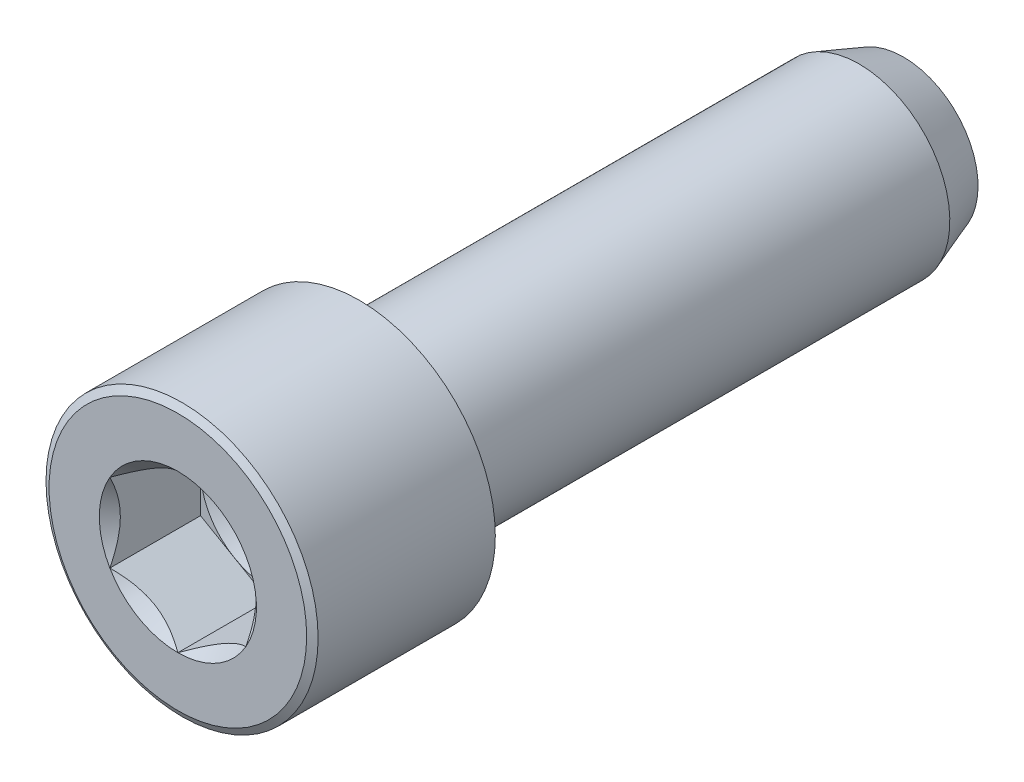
ISO-10303-21;
HEADER;
FILE_DESCRIPTION(('STEP AP214'),'2;1');
FILE_NAME('part.step','',(''),(''),'','','');
FILE_SCHEMA(('AUTOMOTIVE_DESIGN { 1 0 10303 214 1 1 1 1 }'));
ENDSEC;
DATA;
#1=APPLICATION_CONTEXT('core data for automotive mechanical design processes');
#2=APPLICATION_PROTOCOL_DEFINITION('international standard','automotive_design',2000,#1);
#3=PRODUCT_CONTEXT('',#1,'mechanical');
#4=PRODUCT('Part','Part','',(#3));
#5=PRODUCT_RELATED_PRODUCT_CATEGORY('part','',(#4));
#6=PRODUCT_DEFINITION_FORMATION('','',#4);
#7=PRODUCT_DEFINITION_CONTEXT('part definition',#1,'design');
#8=PRODUCT_DEFINITION('design','',#6,#7);
#9=PRODUCT_DEFINITION_SHAPE('','',#8);
#10=(LENGTH_UNIT() NAMED_UNIT(*) SI_UNIT(.MILLI.,.METRE.));
#11=(NAMED_UNIT(*) PLANE_ANGLE_UNIT() SI_UNIT($,.RADIAN.));
#12=(NAMED_UNIT(*) SI_UNIT($,.STERADIAN.) SOLID_ANGLE_UNIT());
#13=UNCERTAINTY_MEASURE_WITH_UNIT(LENGTH_MEASURE(1.E-05),#10,'distance_accuracy_value','');
#14=(GEOMETRIC_REPRESENTATION_CONTEXT(3) GLOBAL_UNCERTAINTY_ASSIGNED_CONTEXT((#13)) GLOBAL_UNIT_ASSIGNED_CONTEXT((#10,
#11,#12)) REPRESENTATION_CONTEXT('',''));
#15=CARTESIAN_POINT('',(0.,0.,0.));
#16=DIRECTION('',(0.,0.,1.));
#17=DIRECTION('',(1.,0.,0.));
#18=AXIS2_PLACEMENT_3D('',#15,#16,#17);
#19=CARTESIAN_POINT('',(-4.7625,0.,3.175));
#20=DIRECTION('',(0.,0.,-1.));
#21=DIRECTION('',(-1.,0.,0.));
#22=AXIS2_PLACEMENT_3D('',#19,#20,#21);
#23=PLANE('',#22);
#24=CARTESIAN_POINT('',(0.,0.,3.175));
#25=DIRECTION('',(0.,0.,1.));
#26=DIRECTION('',(1.,0.,0.));
#27=AXIS2_PLACEMENT_3D('',#24,#25,#26);
#28=CIRCLE('',#27,2.38125);
#29=CARTESIAN_POINT('',(2.38125,0.,3.175));
#30=VERTEX_POINT('',#29);
#31=CARTESIAN_POINT('',(1.190625,2.0622229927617,3.175));
#32=VERTEX_POINT('',#31);
#33=EDGE_CURVE('E54',#30,#32,#28,.T.);
#34=ORIENTED_EDGE('',*,*,#33,.F.);
#35=DIRECTION('',(0.,1.,0.));
#36=VECTOR('',#35,1.);
#37=CARTESIAN_POINT('',(2.38125,-1.3748153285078,3.175));
#38=LINE('',#37,#36);
#39=CARTESIAN_POINT('',(2.38125,1.3748153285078,3.175));
#40=VERTEX_POINT('',#39);
#41=EDGE_CURVE('E124',#30,#40,#38,.T.);
#42=ORIENTED_EDGE('',*,*,#41,.T.);
#43=DIRECTION('',(-0.866025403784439,0.5,0.));
#44=VECTOR('',#43,1.);
#45=CARTESIAN_POINT('',(2.38125,1.3748153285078,3.175));
#46=LINE('',#45,#44);
#47=EDGE_CURVE('E127',#40,#32,#46,.T.);
#48=ORIENTED_EDGE('',*,*,#47,.T.);
#49=EDGE_LOOP('',(#34,#42,#48));
#50=FACE_BOUND('',#49,.T.);
#51=ADVANCED_FACE('F37',(#50),#23,.F.);
#52=CARTESIAN_POINT('',(-1.190625,2.0622229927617,3.175));
#53=VERTEX_POINT('',#52);
#54=EDGE_CURVE('E11',#32,#53,#28,.T.);
#55=ORIENTED_EDGE('',*,*,#54,.F.);
#56=CARTESIAN_POINT('',(0.,2.7496306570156,3.175));
#57=VERTEX_POINT('',#56);
#58=EDGE_CURVE('E141',#32,#57,#46,.T.);
#59=ORIENTED_EDGE('',*,*,#58,.T.);
#60=DIRECTION('',(-0.866025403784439,-0.5,0.));
#61=VECTOR('',#60,1.);
#62=CARTESIAN_POINT('',(0.,2.7496306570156,3.175));
#63=LINE('',#62,#61);
#64=EDGE_CURVE('E147',#57,#53,#63,.T.);
#65=ORIENTED_EDGE('',*,*,#64,.T.);
#66=EDGE_LOOP('',(#55,#59,#65));
#67=FACE_BOUND('',#66,.T.);
#68=ADVANCED_FACE('F303',(#67),#23,.F.);
#69=CARTESIAN_POINT('',(-2.38125,0.,3.175));
#70=VERTEX_POINT('',#69);
#71=EDGE_CURVE('E52',#53,#70,#28,.T.);
#72=ORIENTED_EDGE('',*,*,#71,.F.);
#73=CARTESIAN_POINT('',(-2.38125,1.3748153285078,3.175));
#74=VERTEX_POINT('',#73);
#75=EDGE_CURVE('E146',#53,#74,#63,.T.);
#76=ORIENTED_EDGE('',*,*,#75,.T.);
#77=DIRECTION('',(0.,-1.,0.));
#78=VECTOR('',#77,1.);
#79=CARTESIAN_POINT('',(-2.38125,1.3748153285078,3.175));
#80=LINE('',#79,#78);
#81=EDGE_CURVE('E151',#74,#70,#80,.T.);
#82=ORIENTED_EDGE('',*,*,#81,.T.);
#83=EDGE_LOOP('',(#72,#76,#82));
#84=FACE_BOUND('',#83,.T.);
#85=ADVANCED_FACE('F307',(#84),#23,.F.);
#86=CARTESIAN_POINT('',(-1.190625,-2.0622229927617,3.175));
#87=VERTEX_POINT('',#86);
#88=EDGE_CURVE('E324',#70,#87,#28,.T.);
#89=ORIENTED_EDGE('',*,*,#88,.F.);
#90=CARTESIAN_POINT('',(-2.38125,-1.3748153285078,3.175));
#91=VERTEX_POINT('',#90);
#92=EDGE_CURVE('E150',#70,#91,#80,.T.);
#93=ORIENTED_EDGE('',*,*,#92,.T.);
#94=DIRECTION('',(0.866025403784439,-0.5,0.));
#95=VECTOR('',#94,1.);
#96=CARTESIAN_POINT('',(-2.38125,-1.3748153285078,3.175));
#97=LINE('',#96,#95);
#98=EDGE_CURVE('E244',#91,#87,#97,.T.);
#99=ORIENTED_EDGE('',*,*,#98,.T.);
#100=EDGE_LOOP('',(#89,#93,#99));
#101=FACE_BOUND('',#100,.T.);
#102=ADVANCED_FACE('F318',(#101),#23,.F.);
#103=CARTESIAN_POINT('',(1.190625,-2.06222299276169,3.175));
#104=VERTEX_POINT('',#103);
#105=EDGE_CURVE('E61',#87,#104,#28,.T.);
#106=ORIENTED_EDGE('',*,*,#105,.F.);
#107=CARTESIAN_POINT('',(0.,-2.74963065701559,3.175));
#108=VERTEX_POINT('',#107);
#109=EDGE_CURVE('E228',#87,#108,#97,.T.);
#110=ORIENTED_EDGE('',*,*,#109,.T.);
#111=DIRECTION('',(0.866025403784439,0.5,0.));
#112=VECTOR('',#111,1.);
#113=CARTESIAN_POINT('',(0.,-2.74963065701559,3.175));
#114=LINE('',#113,#112);
#115=EDGE_CURVE('E136',#108,#104,#114,.T.);
#116=ORIENTED_EDGE('',*,*,#115,.T.);
#117=EDGE_LOOP('',(#106,#110,#116));
#118=FACE_BOUND('',#117,.T.);
#119=ADVANCED_FACE('F311',(#118),#23,.F.);
#120=EDGE_CURVE('E114',#104,#30,#28,.T.);
#121=ORIENTED_EDGE('',*,*,#120,.F.);
#122=CARTESIAN_POINT('',(2.38125,-1.3748153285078,3.175));
#123=VERTEX_POINT('',#122);
#124=EDGE_CURVE('E139',#104,#123,#114,.T.);
#125=ORIENTED_EDGE('',*,*,#124,.T.);
#126=EDGE_CURVE('E132',#123,#30,#38,.T.);
#127=ORIENTED_EDGE('',*,*,#126,.T.);
#128=EDGE_LOOP('',(#121,#125,#127));
#129=FACE_BOUND('',#128,.T.);
#130=ADVANCED_FACE('F138',(#129),#23,.F.);
#131=CARTESIAN_POINT('',(0.,0.,0.));
#132=DIRECTION('',(0.,0.,-1.));
#133=DIRECTION('',(0.,1.,0.));
#134=AXIS2_PLACEMENT_3D('',#131,#132,#133);
#135=CYLINDRICAL_SURFACE('',#134,3.175);
#136=CARTESIAN_POINT('',(0.,0.,-17.4974234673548));
#137=DIRECTION('',(0.,0.,-1.));
#138=DIRECTION('',(0.,1.,0.));
#139=AXIS2_PLACEMENT_3D('',#136,#137,#138);
#140=CIRCLE('',#139,3.175);
#141=CARTESIAN_POINT('',(0.,3.175,-17.4974234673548));
#142=VERTEX_POINT('',#141);
#143=EDGE_CURVE('E178',#142,#142,#140,.T.);
#144=ORIENTED_EDGE('',*,*,#143,.F.);
#145=EDGE_LOOP('',(#144));
#146=FACE_BOUND('',#145,.T.);
#147=CARTESIAN_POINT('',(0.,0.,0.));
#148=DIRECTION('',(0.,0.,1.));
#149=DIRECTION('',(1.,0.,0.));
#150=AXIS2_PLACEMENT_3D('',#147,#148,#149);
#151=CIRCLE('',#150,3.175);
#152=CARTESIAN_POINT('',(3.175,0.,0.));
#153=VERTEX_POINT('',#152);
#154=EDGE_CURVE('E172',#153,#153,#151,.F.);
#155=ORIENTED_EDGE('',*,*,#154,.T.);
#156=EDGE_LOOP('',(#155));
#157=FACE_BOUND('',#156,.T.);
#158=ADVANCED_FACE('F310',(#146,#157),#135,.T.);
#159=CARTESIAN_POINT('',(0.,0.,-17.4974234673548));
#160=DIRECTION('',(0.,0.,1.));
#161=DIRECTION('',(0.,-1.,0.));
#162=AXIS2_PLACEMENT_3D('',#159,#160,#161);
#163=CONICAL_SURFACE('',#162,3.175,0.349065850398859);
#164=CARTESIAN_POINT('',(0.,0.,-19.05));
#165=DIRECTION('',(0.,0.,-1.));
#166=DIRECTION('',(0.,1.,0.));
#167=AXIS2_PLACEMENT_3D('',#164,#165,#166);
#168=CIRCLE('',#167,2.60990835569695);
#169=CARTESIAN_POINT('',(0.,2.60990835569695,-19.05));
#170=VERTEX_POINT('',#169);
#171=EDGE_CURVE('E175',#170,#170,#168,.T.);
#172=ORIENTED_EDGE('',*,*,#171,.F.);
#173=EDGE_LOOP('',(#172));
#174=FACE_BOUND('',#173,.T.);
#175=ORIENTED_EDGE('',*,*,#143,.T.);
#176=EDGE_LOOP('',(#175));
#177=FACE_BOUND('',#176,.T.);
#178=ADVANCED_FACE('F316',(#174,#177),#163,.T.);
#179=CARTESIAN_POINT('',(0.,0.,-19.05));
#180=DIRECTION('',(0.,0.,-1.));
#181=DIRECTION('',(0.,1.,0.));
#182=AXIS2_PLACEMENT_3D('',#179,#180,#181);
#183=PLANE('',#182);
#184=ORIENTED_EDGE('',*,*,#171,.T.);
#185=EDGE_LOOP('',(#184));
#186=FACE_BOUND('',#185,.T.);
#187=ADVANCED_FACE('F359',(#186),#183,.T.);
#188=CARTESIAN_POINT('',(0.,0.,6.35));
#189=DIRECTION('',(0.,0.,-1.));
#190=DIRECTION('',(-1.,0.,0.));
#191=AXIS2_PLACEMENT_3D('',#188,#189,#190);
#192=CYLINDRICAL_SURFACE('',#191,4.7625);
#193=CARTESIAN_POINT('',(0.,0.,6.20335303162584));
#194=DIRECTION('',(0.,0.,1.));
#195=DIRECTION('',(1.,0.,0.));
#196=AXIS2_PLACEMENT_3D('',#193,#194,#195);
#197=CIRCLE('',#196,4.7625);
#198=CARTESIAN_POINT('',(4.7625,0.,6.20335303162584));
#199=VERTEX_POINT('',#198);
#200=EDGE_CURVE('E183',#199,#199,#197,.F.);
#201=ORIENTED_EDGE('',*,*,#200,.T.);
#202=EDGE_LOOP('',(#201));
#203=FACE_BOUND('',#202,.T.);
#204=CARTESIAN_POINT('',(0.,0.,0.));
#205=DIRECTION('',(0.,0.,1.));
#206=DIRECTION('',(1.,0.,0.));
#207=AXIS2_PLACEMENT_3D('',#204,#205,#206);
#208=CIRCLE('',#207,4.7625);
#209=CARTESIAN_POINT('',(4.7625,0.,0.));
#210=VERTEX_POINT('',#209);
#211=EDGE_CURVE('E158',#210,#210,#208,.T.);
#212=ORIENTED_EDGE('',*,*,#211,.T.);
#213=EDGE_LOOP('',(#212));
#214=FACE_BOUND('',#213,.T.);
#215=ADVANCED_FACE('F355',(#203,#214),#192,.T.);
#216=CARTESIAN_POINT('',(0.,0.,6.35));
#217=DIRECTION('',(0.,0.,1.));
#218=DIRECTION('',(1.,0.,0.));
#219=AXIS2_PLACEMENT_3D('',#216,#217,#218);
#220=PLANE('',#219);
#221=CARTESIAN_POINT('',(0.,0.,6.35));
#222=DIRECTION('',(0.,0.,1.));
#223=DIRECTION('',(1.,0.,0.));
#224=AXIS2_PLACEMENT_3D('',#221,#222,#223);
#225=CIRCLE('',#224,2.74963065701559);
#226=CARTESIAN_POINT('',(2.38125,1.3748153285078,6.35));
#227=VERTEX_POINT('',#226);
#228=CARTESIAN_POINT('',(0.,2.74963065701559,6.35));
#229=VERTEX_POINT('',#228);
#230=EDGE_CURVE('E211',#227,#229,#225,.T.);
#231=ORIENTED_EDGE('',*,*,#230,.F.);
#232=CARTESIAN_POINT('',(2.38125,-1.3748153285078,6.35));
#233=VERTEX_POINT('',#232);
#234=EDGE_CURVE('E204',#233,#227,#225,.T.);
#235=ORIENTED_EDGE('',*,*,#234,.F.);
#236=CARTESIAN_POINT('',(0.,-2.74963065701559,6.35));
#237=VERTEX_POINT('',#236);
#238=EDGE_CURVE('E197',#237,#233,#225,.T.);
#239=ORIENTED_EDGE('',*,*,#238,.F.);
#240=CARTESIAN_POINT('',(-2.38125,-1.37481532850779,6.35));
#241=VERTEX_POINT('',#240);
#242=EDGE_CURVE('E203',#241,#237,#225,.T.);
#243=ORIENTED_EDGE('',*,*,#242,.F.);
#244=CARTESIAN_POINT('',(-2.38125,1.3748153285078,6.35));
#245=VERTEX_POINT('',#244);
#246=EDGE_CURVE('E68',#245,#241,#225,.T.);
#247=ORIENTED_EDGE('',*,*,#246,.F.);
#248=EDGE_CURVE('E219',#229,#245,#225,.T.);
#249=ORIENTED_EDGE('',*,*,#248,.F.);
#250=EDGE_LOOP('',(#231,#235,#239,#243,#247,#249));
#251=FACE_BOUND('',#250,.T.);
#252=CARTESIAN_POINT('',(0.,0.,6.35));
#253=DIRECTION('',(0.,0.,1.));
#254=DIRECTION('',(1.,0.,0.));
#255=AXIS2_PLACEMENT_3D('',#252,#253,#254);
#256=CIRCLE('',#255,4.5085);
#257=CARTESIAN_POINT('',(4.5085,0.,6.35));
#258=VERTEX_POINT('',#257);
#259=EDGE_CURVE('E181',#258,#258,#256,.T.);
#260=ORIENTED_EDGE('',*,*,#259,.T.);
#261=EDGE_LOOP('',(#260));
#262=FACE_BOUND('',#261,.T.);
#263=ADVANCED_FACE('F214',(#251,#262),#220,.T.);
#264=CARTESIAN_POINT('',(0.,0.,0.));
#265=DIRECTION('',(0.,0.,1.));
#266=DIRECTION('',(1.,0.,0.));
#267=AXIS2_PLACEMENT_3D('',#264,#265,#266);
#268=PLANE('',#267);
#269=ORIENTED_EDGE('',*,*,#154,.F.);
#270=EDGE_LOOP('',(#269));
#271=FACE_BOUND('',#270,.T.);
#272=ORIENTED_EDGE('',*,*,#211,.F.);
#273=EDGE_LOOP('',(#272));
#274=FACE_BOUND('',#273,.T.);
#275=ADVANCED_FACE('F345',(#271,#274),#268,.F.);
#276=CARTESIAN_POINT('',(0.,0.,6.35));
#277=DIRECTION('',(0.,0.,-1.));
#278=DIRECTION('',(-1.,0.,0.));
#279=AXIS2_PLACEMENT_3D('',#276,#277,#278);
#280=CONICAL_SURFACE('',#279,4.5085,1.0471975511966);
#281=ORIENTED_EDGE('',*,*,#200,.F.);
#282=EDGE_LOOP('',(#281));
#283=FACE_BOUND('',#282,.T.);
#284=ORIENTED_EDGE('',*,*,#259,.F.);
#285=EDGE_LOOP('',(#284));
#286=FACE_BOUND('',#285,.T.);
#287=ADVANCED_FACE('F39',(#283,#286),#280,.T.);
#288=CARTESIAN_POINT('',(0.,0.,6.35));
#289=DIRECTION('',(0.,0.,1.));
#290=DIRECTION('',(1.,0.,0.));
#291=AXIS2_PLACEMENT_3D('',#288,#289,#290);
#292=CONICAL_SURFACE('',#291,2.74963065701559,0.78539816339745);
#293=ORIENTED_EDGE('',*,*,#238,.T.);
#294=CARTESIAN_POINT('',(-0.000200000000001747,-2.74974612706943,6.35011547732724));
#295=CARTESIAN_POINT('',(0.0816567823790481,-2.70248609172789,6.30289489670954));
#296=CARTESIAN_POINT('',(0.164882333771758,-2.65443579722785,6.2584475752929));
#297=CARTESIAN_POINT('',(0.334588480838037,-2.556455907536,6.17706545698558));
#298=CARTESIAN_POINT('',(0.4210852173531,-2.50651699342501,6.14017594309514));
#299=CARTESIAN_POINT('',(0.59550177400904,-2.40581754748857,6.07698341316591));
#300=CARTESIAN_POINT('',(0.683377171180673,-2.35508266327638,6.05052155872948));
#301=CARTESIAN_POINT('',(0.861062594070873,-2.25249593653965,6.00975151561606));
#302=CARTESIAN_POINT('',(0.950867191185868,-2.20064722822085,5.99541289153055));
#303=CARTESIAN_POINT('',(1.10563960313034,-2.11128933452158,5.98247578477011));
#304=CARTESIAN_POINT('',(1.17040744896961,-2.07389560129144,5.98056060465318));
#305=CARTESIAN_POINT('',(1.29983727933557,-1.99916925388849,5.98378662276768));
#306=CARTESIAN_POINT('',(1.36449921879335,-1.96183666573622,5.98893029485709));
#307=CARTESIAN_POINT('',(1.49321254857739,-1.88752399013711,6.00598131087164));
#308=CARTESIAN_POINT('',(1.55726317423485,-1.85054434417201,6.01789622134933));
#309=CARTESIAN_POINT('',(1.68425683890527,-1.77722451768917,6.04783567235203));
#310=CARTESIAN_POINT('',(1.74719996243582,-1.74088428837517,6.06585974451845));
#311=CARTESIAN_POINT('',(1.90842615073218,-1.64780030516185,6.11936880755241));
#312=CARTESIAN_POINT('',(2.00570949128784,-1.59163374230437,6.15888742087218));
#313=CARTESIAN_POINT('',(2.14875606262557,-1.50904576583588,6.2256003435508));
#314=CARTESIAN_POINT('',(2.19589628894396,-1.48182934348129,6.24904020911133));
#315=CARTESIAN_POINT('',(2.28930352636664,-1.42790064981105,6.29805667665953));
#316=CARTESIAN_POINT('',(2.33557105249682,-1.40118808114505,6.32363196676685));
#317=CARTESIAN_POINT('',(2.38145,-1.37469985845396,6.35011547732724));
#318=B_SPLINE_CURVE_WITH_KNOTS('',3,(#294,#295,#296,#297,#298,#299,#300,#301,#302,#303,#304,
#305,#306,#307,#308,#309,#310,#311,#312,#313,#314,#315,#316,#317),.UNSPECIFIED.,.F.,.F.,(4,2,2,
2,2,2,2,2,2,2,2,4),(0.,0.317196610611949,0.636241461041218,0.950218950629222,1.26340583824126,
1.48752413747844,1.71172100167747,1.93616888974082,2.16059957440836,2.51709639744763,
2.69486147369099,2.87251813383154),.UNSPECIFIED.);
#319=EDGE_CURVE('E41',#237,#233,#318,.T.);
#320=ORIENTED_EDGE('',*,*,#319,.F.);
#321=EDGE_LOOP('',(#293,#320));
#322=FACE_BOUND('',#321,.T.);
#323=ADVANCED_FACE('F199',(#322),#292,.F.);
#324=ORIENTED_EDGE('',*,*,#234,.T.);
#325=CARTESIAN_POINT('',(2.38125,-2.74194290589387,7.23198089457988));
#326=CARTESIAN_POINT('',(2.38125,-2.67517961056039,7.18158466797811));
#327=CARTESIAN_POINT('',(2.38125,-2.60804251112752,7.1316755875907));
#328=CARTESIAN_POINT('',(2.38125,-2.47287325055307,7.03304983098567));
#329=CARTESIAN_POINT('',(2.38125,-2.40484086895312,6.98433345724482));
#330=CARTESIAN_POINT('',(2.38125,-2.26723593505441,6.88796485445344));
#331=CARTESIAN_POINT('',(2.38125,-2.19765553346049,6.84032379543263));
#332=CARTESIAN_POINT('',(2.38125,-2.05731367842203,6.74681992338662));
#333=CARTESIAN_POINT('',(2.38125,-1.98655230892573,6.7009569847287));
#334=CARTESIAN_POINT('',(2.38125,-1.83957751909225,6.60884590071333));
#335=CARTESIAN_POINT('',(2.38125,-1.76328361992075,6.56272551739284));
#336=CARTESIAN_POINT('',(2.38125,-1.6089135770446,6.47351830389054));
#337=CARTESIAN_POINT('',(2.38125,-1.53083712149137,6.43043200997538));
#338=CARTESIAN_POINT('',(2.38125,-1.37291620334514,6.3482265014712));
#339=CARTESIAN_POINT('',(2.38125,-1.29307799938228,6.30909535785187));
#340=CARTESIAN_POINT('',(2.38125,-1.13121425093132,6.23566795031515));
#341=CARTESIAN_POINT('',(2.38125,-1.04918943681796,6.20137009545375));
#342=CARTESIAN_POINT('',(2.38125,-0.889535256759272,6.14135463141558));
#343=CARTESIAN_POINT('',(2.38125,-0.812083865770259,6.11516847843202));
#344=CARTESIAN_POINT('',(2.38125,-0.655316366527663,6.06900975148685));
#345=CARTESIAN_POINT('',(2.38125,-0.576000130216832,6.04903760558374));
#346=CARTESIAN_POINT('',(2.38125,-0.417295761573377,6.0166821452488));
#347=CARTESIAN_POINT('',(2.38125,-0.337934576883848,6.00416880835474));
#348=CARTESIAN_POINT('',(2.38125,-0.178363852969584,5.98697386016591));
#349=CARTESIAN_POINT('',(2.38125,-0.0981544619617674,5.98229090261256));
#350=CARTESIAN_POINT('',(2.38125,0.0594188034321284,5.98110444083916));
#351=CARTESIAN_POINT('',(2.38125,0.136780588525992,5.9843110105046));
#352=CARTESIAN_POINT('',(2.38125,0.290840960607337,5.99808705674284));
#353=CARTESIAN_POINT('',(2.38125,0.367539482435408,6.00865724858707));
#354=CARTESIAN_POINT('',(2.38125,0.521017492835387,6.03676282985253));
#355=CARTESIAN_POINT('',(2.38125,0.597774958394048,6.05441674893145));
#356=CARTESIAN_POINT('',(2.38125,0.749609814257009,6.0957513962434));
#357=CARTESIAN_POINT('',(2.38125,0.824687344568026,6.11943162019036));
#358=CARTESIAN_POINT('',(2.38125,1.06107814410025,6.20289486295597));
#359=CARTESIAN_POINT('',(2.38125,1.21904786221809,6.27218392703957));
#360=CARTESIAN_POINT('',(2.38125,1.45021000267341,6.38766408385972));
#361=CARTESIAN_POINT('',(2.38125,1.52644290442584,6.42817305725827));
#362=CARTESIAN_POINT('',(2.38125,1.67717618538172,6.51230268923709));
#363=CARTESIAN_POINT('',(2.38125,1.75167687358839,6.55592278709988));
#364=CARTESIAN_POINT('',(2.38125,1.89548152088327,6.64341255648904));
#365=CARTESIAN_POINT('',(2.38125,1.96485959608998,6.6871617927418));
#366=CARTESIAN_POINT('',(2.38125,2.10242624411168,6.77650115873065));
#367=CARTESIAN_POINT('',(2.38125,2.17061472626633,6.82209142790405));
#368=CARTESIAN_POINT('',(2.38125,2.30540317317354,6.91440600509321));
#369=CARTESIAN_POINT('',(2.38125,2.37201154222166,6.96111809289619));
#370=CARTESIAN_POINT('',(2.38125,2.50431800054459,7.05577757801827));
#371=CARTESIAN_POINT('',(2.38125,2.57001633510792,7.10372463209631));
#372=CARTESIAN_POINT('',(2.38125,2.63533378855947,7.15217673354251));
#373=B_SPLINE_CURVE_WITH_KNOTS('',3,(#325,#326,#327,#328,#329,#330,#331,#332,#333,#334,#335,
#336,#337,#338,#339,#340,#341,#342,#343,#344,#345,#346,#347,#348,#349,#350,#351,#352,#353,#354,
#355,#356,#357,#358,#359,#360,#361,#362,#363,#364,#365,#366,#367,#368,#369,#370,#371,#372),
.UNSPECIFIED.,.F.,.F.,(4,2,2,2,2,2,2,2,2,2,2,2,2,2,2,2,2,2,2,2,2,2,2,4),(0.,0.250951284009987,
0.501965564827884,0.754924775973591,1.00786608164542,1.27526207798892,1.54270521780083,
1.80931602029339,2.07583885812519,2.32089852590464,2.56597507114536,2.80664400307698,
3.04727155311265,3.27918940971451,3.51112979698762,3.74712477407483,3.98310000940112,
4.49898139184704,4.75794323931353,5.01685853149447,5.26288960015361,5.50893933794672,
5.75299038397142,5.9969743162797),.UNSPECIFIED.);
#374=EDGE_CURVE('E207',#233,#227,#373,.T.);
#375=ORIENTED_EDGE('',*,*,#374,.F.);
#376=EDGE_LOOP('',(#324,#375));
#377=FACE_BOUND('',#376,.T.);
#378=ADVANCED_FACE('F208',(#377),#292,.F.);
#379=ORIENTED_EDGE('',*,*,#230,.T.);
#380=CARTESIAN_POINT('',(2.38145,1.37469985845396,6.35011547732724));
#381=CARTESIAN_POINT('',(2.29959321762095,1.4219598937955,6.30289489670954));
#382=CARTESIAN_POINT('',(2.21636766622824,1.47001018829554,6.2584475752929));
#383=CARTESIAN_POINT('',(2.04666151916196,1.56799007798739,6.17706545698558));
#384=CARTESIAN_POINT('',(1.9601647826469,1.61792899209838,6.14017594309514));
#385=CARTESIAN_POINT('',(1.78574822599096,1.71862843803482,6.07698341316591));
#386=CARTESIAN_POINT('',(1.69787282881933,1.76936332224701,6.05052155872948));
#387=CARTESIAN_POINT('',(1.52018740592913,1.87195004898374,6.00975151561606));
#388=CARTESIAN_POINT('',(1.43038280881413,1.92379875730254,5.99541289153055));
#389=CARTESIAN_POINT('',(1.27561039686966,2.01315665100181,5.98247578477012));
#390=CARTESIAN_POINT('',(1.21084255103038,2.05055038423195,5.98056060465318));
#391=CARTESIAN_POINT('',(1.08141272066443,2.1252767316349,5.98378662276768));
#392=CARTESIAN_POINT('',(1.01675078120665,2.16260931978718,5.98893029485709));
#393=CARTESIAN_POINT('',(0.888037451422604,2.23692199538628,6.00598131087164));
#394=CARTESIAN_POINT('',(0.823986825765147,2.27390164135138,6.01789622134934));
#395=CARTESIAN_POINT('',(0.696993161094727,2.34722146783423,6.04783567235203));
#396=CARTESIAN_POINT('',(0.634050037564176,2.38356169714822,6.06585974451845));
#397=CARTESIAN_POINT('',(0.472823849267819,2.47664568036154,6.11936880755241));
#398=CARTESIAN_POINT('',(0.37554050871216,2.53281224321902,6.15888742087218));
#399=CARTESIAN_POINT('',(0.23249393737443,2.61540021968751,6.2256003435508));
#400=CARTESIAN_POINT('',(0.185353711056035,2.6426166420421,6.24904020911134));
#401=CARTESIAN_POINT('',(0.0919464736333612,2.69654533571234,6.29805667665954));
#402=CARTESIAN_POINT('',(0.0456789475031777,2.72325790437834,6.32363196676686));
#403=CARTESIAN_POINT('',(-0.000200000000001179,2.74974612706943,6.35011547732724));
#404=B_SPLINE_CURVE_WITH_KNOTS('',3,(#380,#381,#382,#383,#384,#385,#386,#387,#388,#389,#390,
#391,#392,#393,#394,#395,#396,#397,#398,#399,#400,#401,#402,#403),.UNSPECIFIED.,.F.,.F.,(4,2,2,
2,2,2,2,2,2,2,2,4),(0.,0.317196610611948,0.636241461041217,0.950218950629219,1.26340583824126,
1.48752413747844,1.71172100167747,1.93616888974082,2.16059957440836,2.51709639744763,
2.69486147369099,2.87251813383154),.UNSPECIFIED.);
#405=EDGE_CURVE('E210',#227,#229,#404,.T.);
#406=ORIENTED_EDGE('',*,*,#405,.F.);
#407=EDGE_LOOP('',(#379,#406));
#408=FACE_BOUND('',#407,.T.);
#409=ADVANCED_FACE('F333',(#408),#292,.F.);
#410=ORIENTED_EDGE('',*,*,#248,.T.);
#411=CARTESIAN_POINT('',(0.000199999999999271,2.74974612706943,6.35011547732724));
#412=CARTESIAN_POINT('',(-0.0816567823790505,2.70248609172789,6.30289489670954));
#413=CARTESIAN_POINT('',(-0.16488233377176,2.65443579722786,6.2584475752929));
#414=CARTESIAN_POINT('',(-0.334588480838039,2.55645590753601,6.17706545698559));
#415=CARTESIAN_POINT('',(-0.421085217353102,2.50651699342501,6.14017594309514));
#416=CARTESIAN_POINT('',(-0.595501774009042,2.40581754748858,6.07698341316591));
#417=CARTESIAN_POINT('',(-0.683377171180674,2.35508266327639,6.05052155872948));
#418=CARTESIAN_POINT('',(-0.861062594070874,2.25249593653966,6.00975151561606));
#419=CARTESIAN_POINT('',(-0.950867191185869,2.20064722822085,5.99541289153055));
#420=CARTESIAN_POINT('',(-1.10563960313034,2.11128933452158,5.98247578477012));
#421=CARTESIAN_POINT('',(-1.17040744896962,2.07389560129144,5.98056060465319));
#422=CARTESIAN_POINT('',(-1.29983727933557,1.99916925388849,5.98378662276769));
#423=CARTESIAN_POINT('',(-1.36449921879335,1.96183666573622,5.98893029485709));
#424=CARTESIAN_POINT('',(-1.4932125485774,1.88752399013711,6.00598131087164));
#425=CARTESIAN_POINT('',(-1.55726317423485,1.85054434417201,6.01789622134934));
#426=CARTESIAN_POINT('',(-1.68425683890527,1.77722451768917,6.04783567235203));
#427=CARTESIAN_POINT('',(-1.74719996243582,1.74088428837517,6.06585974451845));
#428=CARTESIAN_POINT('',(-1.90842615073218,1.64780030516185,6.11936880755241));
#429=CARTESIAN_POINT('',(-2.00570949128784,1.59163374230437,6.15888742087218));
#430=CARTESIAN_POINT('',(-2.14875606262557,1.50904576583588,6.2256003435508));
#431=CARTESIAN_POINT('',(-2.19589628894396,1.4818293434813,6.24904020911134));
#432=CARTESIAN_POINT('',(-2.28930352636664,1.42790064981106,6.29805667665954));
#433=CARTESIAN_POINT('',(-2.33557105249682,1.40118808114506,6.32363196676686));
#434=CARTESIAN_POINT('',(-2.38145,1.37469985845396,6.35011547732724));
#435=B_SPLINE_CURVE_WITH_KNOTS('',3,(#411,#412,#413,#414,#415,#416,#417,#418,#419,#420,#421,
#422,#423,#424,#425,#426,#427,#428,#429,#430,#431,#432,#433,#434),.UNSPECIFIED.,.F.,.F.,(4,2,2,
2,2,2,2,2,2,2,2,4),(0.,0.317196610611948,0.636241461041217,0.95021895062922,1.26340583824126,
1.48752413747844,1.71172100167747,1.93616888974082,2.16059957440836,2.51709639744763,
2.69486147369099,2.87251813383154),.UNSPECIFIED.);
#436=EDGE_CURVE('E239',#229,#245,#435,.T.);
#437=ORIENTED_EDGE('',*,*,#436,.F.);
#438=EDGE_LOOP('',(#410,#437));
#439=FACE_BOUND('',#438,.T.);
#440=ADVANCED_FACE('F331',(#439),#292,.F.);
#441=ORIENTED_EDGE('',*,*,#246,.T.);
#442=CARTESIAN_POINT('',(-2.38125,-2.74194290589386,7.23198089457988));
#443=CARTESIAN_POINT('',(-2.38125,-2.67517961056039,7.18158466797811));
#444=CARTESIAN_POINT('',(-2.38125,-2.60804251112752,7.13167558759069));
#445=CARTESIAN_POINT('',(-2.38125,-2.47287325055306,7.03304983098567));
#446=CARTESIAN_POINT('',(-2.38125,-2.40484086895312,6.98433345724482));
#447=CARTESIAN_POINT('',(-2.38125,-2.26723593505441,6.88796485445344));
#448=CARTESIAN_POINT('',(-2.38125,-2.19765553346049,6.84032379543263));
#449=CARTESIAN_POINT('',(-2.38125,-2.05731367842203,6.74681992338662));
#450=CARTESIAN_POINT('',(-2.38125,-1.98655230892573,6.7009569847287));
#451=CARTESIAN_POINT('',(-2.38125,-1.83957751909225,6.60884590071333));
#452=CARTESIAN_POINT('',(-2.38125,-1.76328361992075,6.56272551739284));
#453=CARTESIAN_POINT('',(-2.38125,-1.60891357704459,6.47351830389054));
#454=CARTESIAN_POINT('',(-2.38125,-1.53083712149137,6.43043200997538));
#455=CARTESIAN_POINT('',(-2.38125,-1.37291620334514,6.3482265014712));
#456=CARTESIAN_POINT('',(-2.38125,-1.29307799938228,6.30909535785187));
#457=CARTESIAN_POINT('',(-2.38125,-1.13121425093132,6.23566795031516));
#458=CARTESIAN_POINT('',(-2.38125,-1.04918943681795,6.20137009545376));
#459=CARTESIAN_POINT('',(-2.38125,-0.889535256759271,6.14135463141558));
#460=CARTESIAN_POINT('',(-2.38125,-0.812083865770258,6.11516847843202));
#461=CARTESIAN_POINT('',(-2.38125,-0.655316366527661,6.06900975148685));
#462=CARTESIAN_POINT('',(-2.38125,-0.57600013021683,6.04903760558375));
#463=CARTESIAN_POINT('',(-2.38125,-0.417295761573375,6.0166821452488));
#464=CARTESIAN_POINT('',(-2.38125,-0.337934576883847,6.00416880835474));
#465=CARTESIAN_POINT('',(-2.38125,-0.178363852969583,5.98697386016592));
#466=CARTESIAN_POINT('',(-2.38125,-0.0981544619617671,5.98229090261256));
#467=CARTESIAN_POINT('',(-2.38125,0.0594188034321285,5.98110444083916));
#468=CARTESIAN_POINT('',(-2.38125,0.136780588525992,5.9843110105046));
#469=CARTESIAN_POINT('',(-2.38125,0.290840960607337,5.99808705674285));
#470=CARTESIAN_POINT('',(-2.38125,0.367539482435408,6.00865724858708));
#471=CARTESIAN_POINT('',(-2.38125,0.521017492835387,6.03676282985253));
#472=CARTESIAN_POINT('',(-2.38125,0.597774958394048,6.05441674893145));
#473=CARTESIAN_POINT('',(-2.38125,0.749609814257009,6.0957513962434));
#474=CARTESIAN_POINT('',(-2.38125,0.824687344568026,6.11943162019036));
#475=CARTESIAN_POINT('',(-2.38125,1.06107814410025,6.20289486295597));
#476=CARTESIAN_POINT('',(-2.38125,1.2190478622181,6.27218392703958));
#477=CARTESIAN_POINT('',(-2.38125,1.45021000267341,6.38766408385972));
#478=CARTESIAN_POINT('',(-2.38125,1.52644290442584,6.42817305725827));
#479=CARTESIAN_POINT('',(-2.38125,1.67717618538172,6.51230268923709));
#480=CARTESIAN_POINT('',(-2.38125,1.75167687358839,6.55592278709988));
#481=CARTESIAN_POINT('',(-2.38125,1.89548152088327,6.64341255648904));
#482=CARTESIAN_POINT('',(-2.38125,1.96485959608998,6.6871617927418));
#483=CARTESIAN_POINT('',(-2.38125,2.10242624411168,6.77650115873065));
#484=CARTESIAN_POINT('',(-2.38125,2.17061472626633,6.82209142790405));
#485=CARTESIAN_POINT('',(-2.38125,2.30540317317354,6.91440600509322));
#486=CARTESIAN_POINT('',(-2.38125,2.37201154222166,6.96111809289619));
#487=CARTESIAN_POINT('',(-2.38125,2.50431800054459,7.05577757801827));
#488=CARTESIAN_POINT('',(-2.38125,2.57001633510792,7.10372463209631));
#489=CARTESIAN_POINT('',(-2.38125,2.63533378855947,7.15217673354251));
#490=B_SPLINE_CURVE_WITH_KNOTS('',3,(#442,#443,#444,#445,#446,#447,#448,#449,#450,#451,#452,
#453,#454,#455,#456,#457,#458,#459,#460,#461,#462,#463,#464,#465,#466,#467,#468,#469,#470,#471,
#472,#473,#474,#475,#476,#477,#478,#479,#480,#481,#482,#483,#484,#485,#486,#487,#488,#489),
.UNSPECIFIED.,.F.,.F.,(4,2,2,2,2,2,2,2,2,2,2,2,2,2,2,2,2,2,2,2,2,2,2,4),(0.,0.250951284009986,
0.501965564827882,0.754924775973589,1.00786608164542,1.27526207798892,1.54270521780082,
1.80931602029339,2.07583885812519,2.32089852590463,2.56597507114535,2.80664400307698,
3.04727155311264,3.2791894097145,3.51112979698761,3.74712477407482,3.98310000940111,
4.49898139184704,4.75794323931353,5.01685853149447,5.2628896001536,5.50893933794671,
5.75299038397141,5.99697431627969),.UNSPECIFIED.);
#491=EDGE_CURVE('E229',#245,#241,#490,.F.);
#492=ORIENTED_EDGE('',*,*,#491,.F.);
#493=EDGE_LOOP('',(#441,#492));
#494=FACE_BOUND('',#493,.T.);
#495=ADVANCED_FACE('F264',(#494),#292,.F.);
#496=ORIENTED_EDGE('',*,*,#242,.T.);
#497=CARTESIAN_POINT('',(-2.38145,-1.37469985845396,6.35011547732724));
#498=CARTESIAN_POINT('',(-2.29959321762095,-1.4219598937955,6.30289489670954));
#499=CARTESIAN_POINT('',(-2.21636766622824,-1.47001018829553,6.2584475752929));
#500=CARTESIAN_POINT('',(-2.04666151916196,-1.56799007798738,6.17706545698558));
#501=CARTESIAN_POINT('',(-1.9601647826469,-1.61792899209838,6.14017594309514));
#502=CARTESIAN_POINT('',(-1.78574822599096,-1.71862843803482,6.07698341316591));
#503=CARTESIAN_POINT('',(-1.69787282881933,-1.769363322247,6.05052155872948));
#504=CARTESIAN_POINT('',(-1.52018740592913,-1.87195004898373,6.00975151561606));
#505=CARTESIAN_POINT('',(-1.43038280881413,-1.92379875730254,5.99541289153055));
#506=CARTESIAN_POINT('',(-1.27561039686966,-2.01315665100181,5.98247578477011));
#507=CARTESIAN_POINT('',(-1.21084255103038,-2.05055038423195,5.98056060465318));
#508=CARTESIAN_POINT('',(-1.08141272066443,-2.1252767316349,5.98378662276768));
#509=CARTESIAN_POINT('',(-1.01675078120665,-2.16260931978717,5.98893029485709));
#510=CARTESIAN_POINT('',(-0.888037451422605,-2.23692199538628,6.00598131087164));
#511=CARTESIAN_POINT('',(-0.823986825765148,-2.27390164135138,6.01789622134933));
#512=CARTESIAN_POINT('',(-0.696993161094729,-2.34722146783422,6.04783567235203));
#513=CARTESIAN_POINT('',(-0.634050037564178,-2.38356169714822,6.06585974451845));
#514=CARTESIAN_POINT('',(-0.472823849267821,-2.47664568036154,6.11936880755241));
#515=CARTESIAN_POINT('',(-0.375540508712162,-2.53281224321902,6.15888742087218));
#516=CARTESIAN_POINT('',(-0.232493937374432,-2.61540021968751,6.2256003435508));
#517=CARTESIAN_POINT('',(-0.185353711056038,-2.64261664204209,6.24904020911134));
#518=CARTESIAN_POINT('',(-0.0919464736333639,-2.69654533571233,6.29805667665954));
#519=CARTESIAN_POINT('',(-0.0456789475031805,-2.72325790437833,6.32363196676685));
#520=CARTESIAN_POINT('',(0.000199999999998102,-2.74974612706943,6.35011547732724));
#521=B_SPLINE_CURVE_WITH_KNOTS('',3,(#497,#498,#499,#500,#501,#502,#503,#504,#505,#506,#507,
#508,#509,#510,#511,#512,#513,#514,#515,#516,#517,#518,#519,#520),.UNSPECIFIED.,.F.,.F.,(4,2,2,
2,2,2,2,2,2,2,2,4),(0.,0.317196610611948,0.636241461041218,0.950218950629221,1.26340583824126,
1.48752413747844,1.71172100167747,1.93616888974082,2.16059957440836,2.51709639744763,
2.69486147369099,2.87251813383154),.UNSPECIFIED.);
#522=EDGE_CURVE('E225',#241,#237,#521,.T.);
#523=ORIENTED_EDGE('',*,*,#522,.F.);
#524=EDGE_LOOP('',(#496,#523));
#525=FACE_BOUND('',#524,.T.);
#526=ADVANCED_FACE('F224',(#525),#292,.F.);
#527=CARTESIAN_POINT('',(0.,-2.74963065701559,3.175));
#528=DIRECTION('',(0.5,-0.866025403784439,0.));
#529=DIRECTION('',(0.866025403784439,0.5,0.));
#530=AXIS2_PLACEMENT_3D('',#527,#528,#529);
#531=PLANE('',#530);
#532=DIRECTION('',(0.,0.,1.));
#533=VECTOR('',#532,1.);
#534=CARTESIAN_POINT('',(0.,-2.74963065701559,3.175));
#535=LINE('',#534,#533);
#536=EDGE_CURVE('E154',#108,#237,#535,.T.);
#537=ORIENTED_EDGE('',*,*,#536,.T.);
#538=ORIENTED_EDGE('',*,*,#319,.T.);
#539=DIRECTION('',(0.,0.,1.));
#540=VECTOR('',#539,1.);
#541=CARTESIAN_POINT('',(2.38125,-1.3748153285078,3.175));
#542=LINE('',#541,#540);
#543=EDGE_CURVE('E166',#123,#233,#542,.T.);
#544=ORIENTED_EDGE('',*,*,#543,.F.);
#545=ORIENTED_EDGE('',*,*,#124,.F.);
#546=ORIENTED_EDGE('',*,*,#115,.F.);
#547=EDGE_LOOP('',(#537,#538,#544,#545,#546));
#548=FACE_BOUND('',#547,.T.);
#549=ADVANCED_FACE('F191',(#548),#531,.F.);
#550=CARTESIAN_POINT('',(2.38125,-1.3748153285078,3.175));
#551=DIRECTION('',(1.,0.,0.));
#552=DIRECTION('',(0.,1.,0.));
#553=AXIS2_PLACEMENT_3D('',#550,#551,#552);
#554=PLANE('',#553);
#555=ORIENTED_EDGE('',*,*,#543,.T.);
#556=ORIENTED_EDGE('',*,*,#374,.T.);
#557=DIRECTION('',(0.,0.,1.));
#558=VECTOR('',#557,1.);
#559=CARTESIAN_POINT('',(2.38125,1.3748153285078,3.175));
#560=LINE('',#559,#558);
#561=EDGE_CURVE('E135',#40,#227,#560,.T.);
#562=ORIENTED_EDGE('',*,*,#561,.F.);
#563=ORIENTED_EDGE('',*,*,#41,.F.);
#564=ORIENTED_EDGE('',*,*,#126,.F.);
#565=EDGE_LOOP('',(#555,#556,#562,#563,#564));
#566=FACE_BOUND('',#565,.T.);
#567=ADVANCED_FACE('F131',(#566),#554,.F.);
#568=CARTESIAN_POINT('',(2.38125,1.3748153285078,3.175));
#569=DIRECTION('',(0.5,0.866025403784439,0.));
#570=DIRECTION('',(-0.866025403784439,0.5,0.));
#571=AXIS2_PLACEMENT_3D('',#568,#569,#570);
#572=PLANE('',#571);
#573=ORIENTED_EDGE('',*,*,#561,.T.);
#574=ORIENTED_EDGE('',*,*,#405,.T.);
#575=DIRECTION('',(0.,0.,1.));
#576=VECTOR('',#575,1.);
#577=CARTESIAN_POINT('',(0.,2.7496306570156,3.175));
#578=LINE('',#577,#576);
#579=EDGE_CURVE('E162',#57,#229,#578,.T.);
#580=ORIENTED_EDGE('',*,*,#579,.F.);
#581=ORIENTED_EDGE('',*,*,#58,.F.);
#582=ORIENTED_EDGE('',*,*,#47,.F.);
#583=EDGE_LOOP('',(#573,#574,#580,#581,#582));
#584=FACE_BOUND('',#583,.T.);
#585=ADVANCED_FACE('F290',(#584),#572,.F.);
#586=CARTESIAN_POINT('',(0.,2.7496306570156,3.175));
#587=DIRECTION('',(-0.5,0.866025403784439,0.));
#588=DIRECTION('',(-0.866025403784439,-0.5,0.));
#589=AXIS2_PLACEMENT_3D('',#586,#587,#588);
#590=PLANE('',#589);
#591=ORIENTED_EDGE('',*,*,#579,.T.);
#592=ORIENTED_EDGE('',*,*,#436,.T.);
#593=DIRECTION('',(0.,0.,1.));
#594=VECTOR('',#593,1.);
#595=CARTESIAN_POINT('',(-2.38125,1.3748153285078,3.175));
#596=LINE('',#595,#594);
#597=EDGE_CURVE('E159',#74,#245,#596,.T.);
#598=ORIENTED_EDGE('',*,*,#597,.F.);
#599=ORIENTED_EDGE('',*,*,#75,.F.);
#600=ORIENTED_EDGE('',*,*,#64,.F.);
#601=EDGE_LOOP('',(#591,#592,#598,#599,#600));
#602=FACE_BOUND('',#601,.T.);
#603=ADVANCED_FACE('F287',(#602),#590,.F.);
#604=CARTESIAN_POINT('',(-2.38125,1.3748153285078,3.175));
#605=DIRECTION('',(-1.,0.,0.));
#606=DIRECTION('',(0.,-1.,0.));
#607=AXIS2_PLACEMENT_3D('',#604,#605,#606);
#608=PLANE('',#607);
#609=ORIENTED_EDGE('',*,*,#597,.T.);
#610=ORIENTED_EDGE('',*,*,#491,.T.);
#611=DIRECTION('',(0.,0.,1.));
#612=VECTOR('',#611,1.);
#613=CARTESIAN_POINT('',(-2.38125,-1.3748153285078,3.175));
#614=LINE('',#613,#612);
#615=EDGE_CURVE('E155',#91,#241,#614,.T.);
#616=ORIENTED_EDGE('',*,*,#615,.F.);
#617=ORIENTED_EDGE('',*,*,#92,.F.);
#618=ORIENTED_EDGE('',*,*,#81,.F.);
#619=EDGE_LOOP('',(#609,#610,#616,#617,#618));
#620=FACE_BOUND('',#619,.T.);
#621=ADVANCED_FACE('F233',(#620),#608,.F.);
#622=CARTESIAN_POINT('',(-2.38125,-1.3748153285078,3.175));
#623=DIRECTION('',(-0.5,-0.866025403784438,0.));
#624=DIRECTION('',(0.866025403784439,-0.5,0.));
#625=AXIS2_PLACEMENT_3D('',#622,#623,#624);
#626=PLANE('',#625);
#627=ORIENTED_EDGE('',*,*,#615,.T.);
#628=ORIENTED_EDGE('',*,*,#522,.T.);
#629=ORIENTED_EDGE('',*,*,#536,.F.);
#630=ORIENTED_EDGE('',*,*,#109,.F.);
#631=ORIENTED_EDGE('',*,*,#98,.F.);
#632=EDGE_LOOP('',(#627,#628,#629,#630,#631));
#633=FACE_BOUND('',#632,.T.);
#634=ADVANCED_FACE('F241',(#633),#626,.F.);
#635=CARTESIAN_POINT('',(0.,0.,3.175));
#636=DIRECTION('',(0.,0.,1.));
#637=DIRECTION('',(1.,0.,0.));
#638=AXIS2_PLACEMENT_3D('',#635,#636,#637);
#639=CONICAL_SURFACE('',#638,2.38125,1.0471975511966);
#640=CARTESIAN_POINT('',(0.,0.,2.11666666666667));
#641=DIRECTION('',(0.,0.,1.));
#642=DIRECTION('',(1.,0.,0.));
#643=AXIS2_PLACEMENT_3D('',#640,#641,#642);
#644=CIRCLE('',#643,0.54816289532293);
#645=CARTESIAN_POINT('',(0.54816289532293,0.,2.11666666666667));
#646=VERTEX_POINT('',#645);
#647=EDGE_CURVE('E128',#646,#646,#644,.T.);
#648=ORIENTED_EDGE('',*,*,#647,.F.);
#649=EDGE_LOOP('',(#648));
#650=FACE_BOUND('',#649,.T.);
#651=ORIENTED_EDGE('',*,*,#33,.T.);
#652=ORIENTED_EDGE('',*,*,#54,.T.);
#653=ORIENTED_EDGE('',*,*,#71,.T.);
#654=ORIENTED_EDGE('',*,*,#88,.T.);
#655=ORIENTED_EDGE('',*,*,#105,.T.);
#656=ORIENTED_EDGE('',*,*,#120,.T.);
#657=EDGE_LOOP('',(#651,#652,#653,#654,#655,#656));
#658=FACE_BOUND('',#657,.T.);
#659=ADVANCED_FACE('F116',(#650,#658),#639,.F.);
#660=CARTESIAN_POINT('',(0.,0.,2.11666666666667));
#661=DIRECTION('',(0.,0.,1.));
#662=DIRECTION('',(1.,0.,0.));
#663=AXIS2_PLACEMENT_3D('',#660,#661,#662);
#664=PLANE('',#663);
#665=ORIENTED_EDGE('',*,*,#647,.T.);
#666=EDGE_LOOP('',(#665));
#667=FACE_BOUND('',#666,.T.);
#668=ADVANCED_FACE('F502',(#667),#664,.T.);
#669=CLOSED_SHELL('',(#51,#68,#85,#102,#119,#130,#158,#178,#187,#215,#263,#275,#287,#323,#378,
#409,#440,#495,#526,#549,#567,#585,#603,#621,#634,#659,#668));
#670=MANIFOLD_SOLID_BREP('B2',#669);
#671=ADVANCED_BREP_SHAPE_REPRESENTATION('',(#18,#670),#14);
#672=SHAPE_DEFINITION_REPRESENTATION(#9,#671);
ENDSEC;
END-ISO-10303-21;
